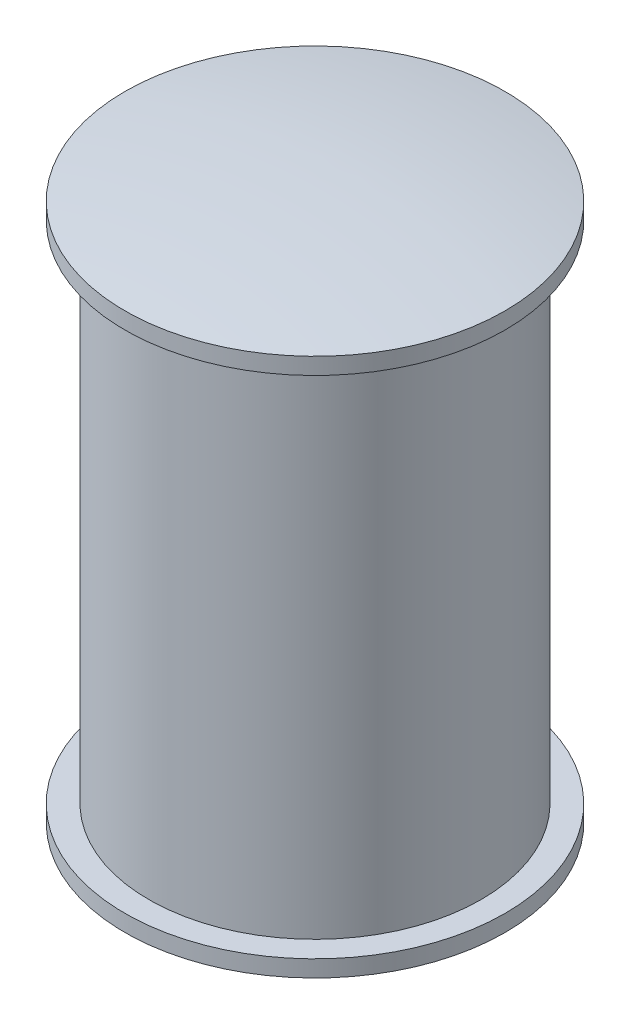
from build123d import *

# Parameters (mm, degrees)
SKETCH1_W           = 1
SKETCH1_H           = 1.52
SKETCH2_R           = 1.143671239
BOSS_EXTRUDE1_DEPTH = 0.1
DOME1_FACE_RADIUS   = 1.143671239
DOME1_HEIGHT        = 0.1


with BuildPart() as part:
    # Sketch1 → Revolve1 (revolve)
    with BuildSketch(Plane.XY, mode=Mode.PRIVATE) as revolve1_sk:
        Rectangle(SKETCH1_W, SKETCH1_H)
    revolve(revolve1_sk.sketch.rotate(Axis((0.5, 0.76, 0), (0, 1, 0)), 180), axis=Axis((0.5, 0.76, 0), (0, 1, 0)))

    # Sketch2 → Boss-Extrude1 (add)
    with BuildSketch(Plane(origin=(0, 0.76, 0), x_dir=(1, 0, 0), z_dir=(0, 1, 0))):
        with Locations(Location((0.5, 0, 0), (0, 0, 180))):
            Circle(SKETCH2_R)
    extrude(amount=BOSS_EXTRUDE1_DEPTH)

    # Dome1: a dome of height H over a round flat face of radius A is a cap of a sphere of radius (A * A + H * H) / (2 * H)
    dome1_r = (DOME1_FACE_RADIUS * DOME1_FACE_RADIUS + DOME1_HEIGHT * DOME1_HEIGHT) / (2 * DOME1_HEIGHT)
    dome1_base = Plane((0.5, 0.86, 0), z_dir=(0, 1, 0))
    with Locations(dome1_base.offset(DOME1_HEIGHT - dome1_r)):
        dome1_ball = Sphere(dome1_r, mode=Mode.PRIVATE)
    add(split(dome1_ball, bisect_by=dome1_base, keep=Keep.TOP, mode=Mode.PRIVATE))

    # Mirror1: part across plane


with BuildPart() as part_1:
    add(part.part)
    add(part.part.mirror(Plane(origin=(0, -0.76, 0), x_dir=(0, 0, 1), z_dir=(0, -1, 0))))


solid = part_1.part
